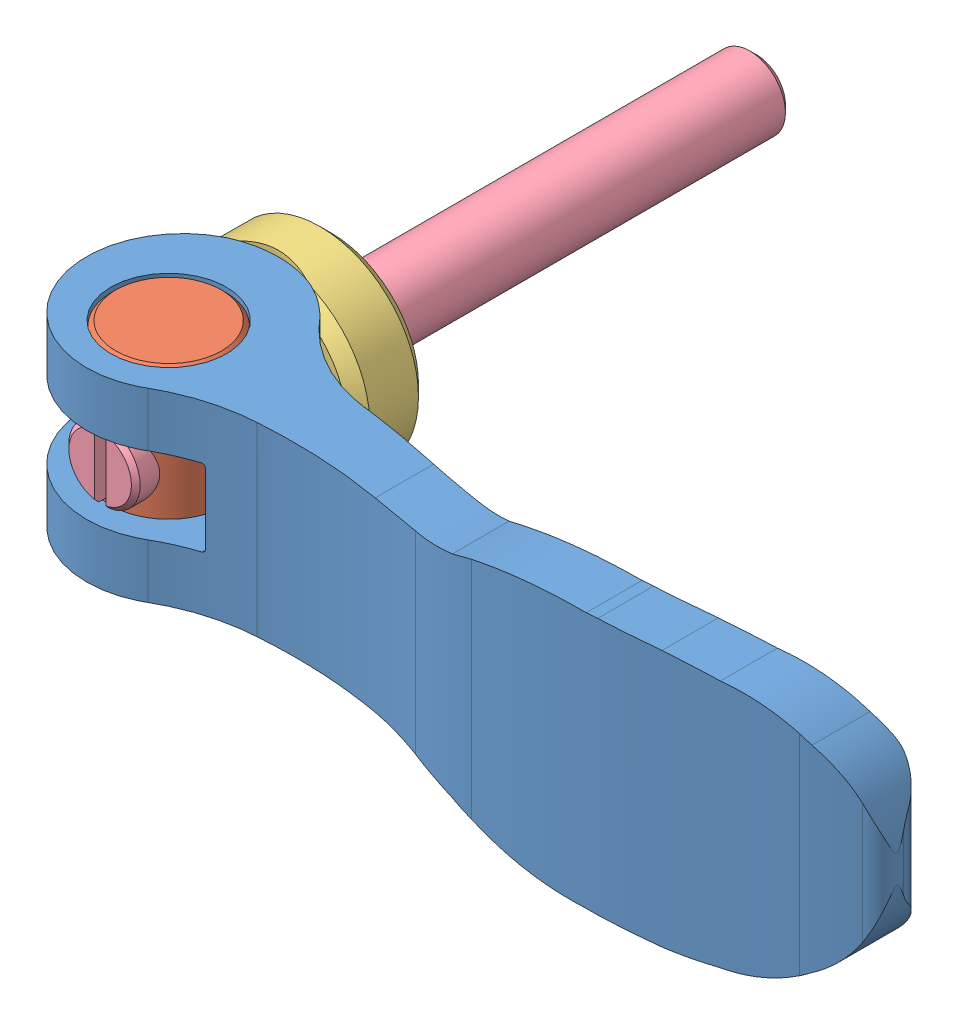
SolidWorks assembly KCL05AX30-SUS.SLDASM, configuration Default (file format 15000). Lengths in mm.
Overall size (59.2 18.05 47.01).
4 component instances, 4 part files, 0 mates.
Components (placement in the parent):
- KCL05AX30-SUS_01-1: KCL05AX30-SUS_01.SLDPRT [ﾃﾞﾌｫﾙﾄ] at (0 0 11.4) x (1 0 0) z (0 -1 0) size (59.1 13.57 18.05)
- KCL05AX30-SUS_02-1: KCL05AX30-SUS_02.SLDPRT [ﾃﾞﾌｫﾙﾄ] at (0 0 11.4) x (0 1 0) z (1 0 0) size (13 8 8)
- KCL05AX30-SUS_03-1: KCL05AX30-SUS_03.SLDPRT [ﾃﾞﾌｫﾙﾄ] x (1 0 0) z (0 -1 0) size (13.8 5.38 13.8)
- KCL05AX30-SUS_04-1: KCL05AX30-SUS_04.SLDPRT [ﾃﾞﾌｫﾙﾄ] at (0 0 -19.8) x (0 1 0) z (1 0 0) size (5 46 5)
